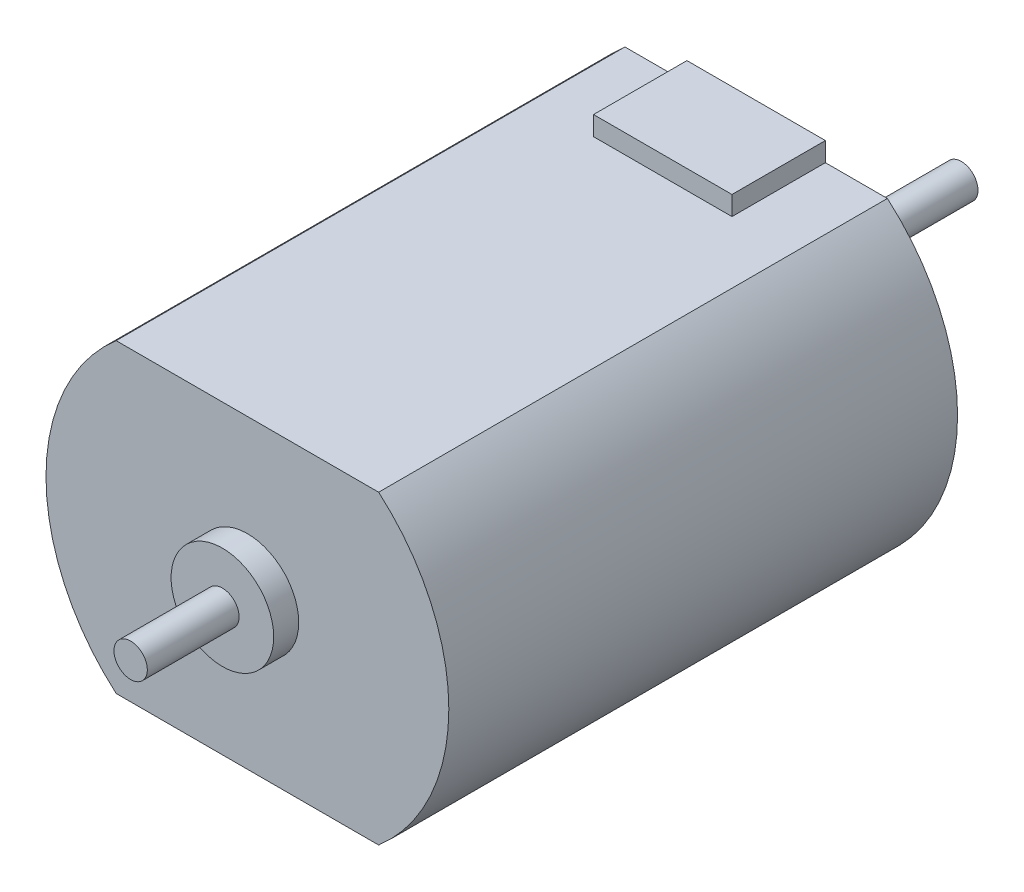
ISO-10303-21;
HEADER;
FILE_DESCRIPTION(('STEP AP214'),'2;1');
FILE_NAME('part.step','',(''),(''),'','','');
FILE_SCHEMA(('AUTOMOTIVE_DESIGN { 1 0 10303 214 1 1 1 1 }'));
ENDSEC;
DATA;
#1=APPLICATION_CONTEXT('core data for automotive mechanical design processes');
#2=APPLICATION_PROTOCOL_DEFINITION('international standard','automotive_design',2000,#1);
#3=PRODUCT_CONTEXT('',#1,'mechanical');
#4=PRODUCT('Part','Part','',(#3));
#5=PRODUCT_RELATED_PRODUCT_CATEGORY('part','',(#4));
#6=PRODUCT_DEFINITION_FORMATION('','',#4);
#7=PRODUCT_DEFINITION_CONTEXT('part definition',#1,'design');
#8=PRODUCT_DEFINITION('design','',#6,#7);
#9=PRODUCT_DEFINITION_SHAPE('','',#8);
#10=(LENGTH_UNIT() NAMED_UNIT(*) SI_UNIT(.MILLI.,.METRE.));
#11=(NAMED_UNIT(*) PLANE_ANGLE_UNIT() SI_UNIT($,.RADIAN.));
#12=(NAMED_UNIT(*) SI_UNIT($,.STERADIAN.) SOLID_ANGLE_UNIT());
#13=UNCERTAINTY_MEASURE_WITH_UNIT(LENGTH_MEASURE(1.E-05),#10,'distance_accuracy_value','');
#14=(GEOMETRIC_REPRESENTATION_CONTEXT(3) GLOBAL_UNCERTAINTY_ASSIGNED_CONTEXT((#13)) GLOBAL_UNIT_ASSIGNED_CONTEXT((#10,
#11,#12)) REPRESENTATION_CONTEXT('',''));
#15=CARTESIAN_POINT('',(0.,0.,0.));
#16=DIRECTION('',(0.,0.,1.));
#17=DIRECTION('',(1.,0.,0.));
#18=AXIS2_PLACEMENT_3D('',#15,#16,#17);
#19=CARTESIAN_POINT('',(-7.86765689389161,9.16,30.5));
#20=DIRECTION('',(0.,-1.,0.));
#21=DIRECTION('',(0.,0.,-1.));
#22=AXIS2_PLACEMENT_3D('',#19,#20,#21);
#23=PLANE('',#22);
#24=DIRECTION('',(0.,0.,1.));
#25=VECTOR('',#24,1.);
#26=CARTESIAN_POINT('',(-4.15,9.16,0.));
#27=LINE('',#26,#25);
#28=CARTESIAN_POINT('',(-4.15,9.16,0.));
#29=VERTEX_POINT('',#28);
#30=CARTESIAN_POINT('',(-4.15,9.16,5.6));
#31=VERTEX_POINT('',#30);
#32=EDGE_CURVE('E68',#29,#31,#27,.T.);
#33=ORIENTED_EDGE('',*,*,#32,.F.);
#34=DIRECTION('',(-1.,0.,0.));
#35=VECTOR('',#34,1.);
#36=CARTESIAN_POINT('',(-7.86765689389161,9.16,0.));
#37=LINE('',#36,#35);
#38=CARTESIAN_POINT('',(-7.86765689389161,9.16,0.));
#39=VERTEX_POINT('',#38);
#40=EDGE_CURVE('E177',#29,#39,#37,.T.);
#41=ORIENTED_EDGE('',*,*,#40,.T.);
#42=DIRECTION('',(0.,0.,-1.));
#43=VECTOR('',#42,1.);
#44=CARTESIAN_POINT('',(-7.86765689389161,9.16,30.5));
#45=LINE('',#44,#43);
#46=CARTESIAN_POINT('',(-7.86765689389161,9.16,30.5));
#47=VERTEX_POINT('',#46);
#48=EDGE_CURVE('E192',#47,#39,#45,.T.);
#49=ORIENTED_EDGE('',*,*,#48,.F.);
#50=DIRECTION('',(-1.,0.,0.));
#51=VECTOR('',#50,1.);
#52=CARTESIAN_POINT('',(-7.86765689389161,9.16,30.5));
#53=LINE('',#52,#51);
#54=CARTESIAN_POINT('',(7.86765689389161,9.16,30.5));
#55=VERTEX_POINT('',#54);
#56=EDGE_CURVE('E163',#55,#47,#53,.T.);
#57=ORIENTED_EDGE('',*,*,#56,.F.);
#58=DIRECTION('',(0.,0.,-1.));
#59=VECTOR('',#58,1.);
#60=CARTESIAN_POINT('',(7.86765689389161,9.16,30.5));
#61=LINE('',#60,#59);
#62=CARTESIAN_POINT('',(7.86765689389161,9.16,0.));
#63=VERTEX_POINT('',#62);
#64=EDGE_CURVE('E49',#55,#63,#61,.T.);
#65=ORIENTED_EDGE('',*,*,#64,.T.);
#66=CARTESIAN_POINT('',(4.15,9.16,0.));
#67=VERTEX_POINT('',#66);
#68=EDGE_CURVE('E178',#63,#67,#37,.T.);
#69=ORIENTED_EDGE('',*,*,#68,.T.);
#70=DIRECTION('',(0.,0.,-1.));
#71=VECTOR('',#70,1.);
#72=CARTESIAN_POINT('',(4.15,9.16,0.));
#73=LINE('',#72,#71);
#74=CARTESIAN_POINT('',(4.15,9.16,5.6));
#75=VERTEX_POINT('',#74);
#76=EDGE_CURVE('E132',#75,#67,#73,.T.);
#77=ORIENTED_EDGE('',*,*,#76,.F.);
#78=DIRECTION('',(1.,0.,0.));
#79=VECTOR('',#78,1.);
#80=CARTESIAN_POINT('',(-4.15,9.16,5.6));
#81=LINE('',#80,#79);
#82=EDGE_CURVE('E63',#31,#75,#81,.T.);
#83=ORIENTED_EDGE('',*,*,#82,.F.);
#84=EDGE_LOOP('',(#33,#41,#49,#57,#65,#69,#77,#83));
#85=FACE_BOUND('',#84,.T.);
#86=ADVANCED_FACE('F45',(#85),#23,.F.);
#87=CARTESIAN_POINT('',(0.,0.,30.5));
#88=DIRECTION('',(0.,0.,-1.));
#89=DIRECTION('',(-1.,0.,0.));
#90=AXIS2_PLACEMENT_3D('',#87,#88,#89);
#91=CYLINDRICAL_SURFACE('',#90,12.075);
#92=CARTESIAN_POINT('',(0.,0.,0.));
#93=DIRECTION('',(0.,0.,1.));
#94=DIRECTION('',(1.,0.,0.));
#95=AXIS2_PLACEMENT_3D('',#92,#93,#94);
#96=CIRCLE('',#95,12.075);
#97=CARTESIAN_POINT('',(7.86765689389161,-9.16,0.));
#98=VERTEX_POINT('',#97);
#99=EDGE_CURVE('E155',#98,#63,#96,.T.);
#100=ORIENTED_EDGE('',*,*,#99,.T.);
#101=ORIENTED_EDGE('',*,*,#64,.F.);
#102=CARTESIAN_POINT('',(0.,0.,30.5));
#103=DIRECTION('',(0.,0.,1.));
#104=DIRECTION('',(1.,0.,0.));
#105=AXIS2_PLACEMENT_3D('',#102,#103,#104);
#106=CIRCLE('',#105,12.075);
#107=CARTESIAN_POINT('',(7.86765689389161,-9.16,30.5));
#108=VERTEX_POINT('',#107);
#109=EDGE_CURVE('E159',#108,#55,#106,.T.);
#110=ORIENTED_EDGE('',*,*,#109,.F.);
#111=DIRECTION('',(0.,0.,-1.));
#112=VECTOR('',#111,1.);
#113=CARTESIAN_POINT('',(7.86765689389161,-9.16,30.5));
#114=LINE('',#113,#112);
#115=EDGE_CURVE('E173',#108,#98,#114,.T.);
#116=ORIENTED_EDGE('',*,*,#115,.T.);
#117=EDGE_LOOP('',(#100,#101,#110,#116));
#118=FACE_BOUND('',#117,.T.);
#119=ADVANCED_FACE('F47',(#118),#91,.T.);
#120=CARTESIAN_POINT('',(0.,0.,30.5));
#121=DIRECTION('',(0.,0.,-1.));
#122=DIRECTION('',(-1.,0.,0.));
#123=AXIS2_PLACEMENT_3D('',#120,#121,#122);
#124=CYLINDRICAL_SURFACE('',#123,12.075);
#125=CARTESIAN_POINT('',(0.,0.,0.));
#126=DIRECTION('',(0.,0.,1.));
#127=DIRECTION('',(1.,0.,0.));
#128=AXIS2_PLACEMENT_3D('',#125,#126,#127);
#129=CIRCLE('',#128,12.075);
#130=CARTESIAN_POINT('',(-7.86765689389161,-9.16,0.));
#131=VERTEX_POINT('',#130);
#132=EDGE_CURVE('E181',#39,#131,#129,.T.);
#133=ORIENTED_EDGE('',*,*,#132,.T.);
#134=DIRECTION('',(0.,0.,-1.));
#135=VECTOR('',#134,1.);
#136=CARTESIAN_POINT('',(-7.86765689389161,-9.16,30.5));
#137=LINE('',#136,#135);
#138=CARTESIAN_POINT('',(-7.86765689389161,-9.16,30.5));
#139=VERTEX_POINT('',#138);
#140=EDGE_CURVE('E189',#139,#131,#137,.T.);
#141=ORIENTED_EDGE('',*,*,#140,.F.);
#142=CARTESIAN_POINT('',(0.,0.,30.5));
#143=DIRECTION('',(0.,0.,1.));
#144=DIRECTION('',(1.,0.,0.));
#145=AXIS2_PLACEMENT_3D('',#142,#143,#144);
#146=CIRCLE('',#145,12.075);
#147=EDGE_CURVE('E167',#47,#139,#146,.T.);
#148=ORIENTED_EDGE('',*,*,#147,.F.);
#149=ORIENTED_EDGE('',*,*,#48,.T.);
#150=EDGE_LOOP('',(#133,#141,#148,#149));
#151=FACE_BOUND('',#150,.T.);
#152=ADVANCED_FACE('F268',(#151),#124,.T.);
#153=CARTESIAN_POINT('',(-7.86765689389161,-9.16,30.5));
#154=DIRECTION('',(0.,1.,0.));
#155=DIRECTION('',(0.,0.,1.));
#156=AXIS2_PLACEMENT_3D('',#153,#154,#155);
#157=PLANE('',#156);
#158=DIRECTION('',(1.,0.,0.));
#159=VECTOR('',#158,1.);
#160=CARTESIAN_POINT('',(-7.86765689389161,-9.16,0.));
#161=LINE('',#160,#159);
#162=EDGE_CURVE('E164',#131,#98,#161,.T.);
#163=ORIENTED_EDGE('',*,*,#162,.T.);
#164=ORIENTED_EDGE('',*,*,#115,.F.);
#165=DIRECTION('',(1.,0.,0.));
#166=VECTOR('',#165,1.);
#167=CARTESIAN_POINT('',(-7.86765689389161,-9.16,30.5));
#168=LINE('',#167,#166);
#169=EDGE_CURVE('E170',#139,#108,#168,.T.);
#170=ORIENTED_EDGE('',*,*,#169,.F.);
#171=ORIENTED_EDGE('',*,*,#140,.T.);
#172=EDGE_LOOP('',(#163,#164,#170,#171));
#173=FACE_BOUND('',#172,.T.);
#174=ADVANCED_FACE('F263',(#173),#157,.F.);
#175=CARTESIAN_POINT('',(0.,0.,30.5));
#176=DIRECTION('',(0.,0.,1.));
#177=DIRECTION('',(1.,0.,0.));
#178=AXIS2_PLACEMENT_3D('',#175,#176,#177);
#179=PLANE('',#178);
#180=CARTESIAN_POINT('',(0.,0.,30.5));
#181=DIRECTION('',(0.,0.,1.));
#182=DIRECTION('',(1.,0.,0.));
#183=AXIS2_PLACEMENT_3D('',#180,#181,#182);
#184=CIRCLE('',#183,3.075);
#185=CARTESIAN_POINT('',(3.075,0.,30.5));
#186=VERTEX_POINT('',#185);
#187=EDGE_CURVE('E55',#186,#186,#184,.T.);
#188=ORIENTED_EDGE('',*,*,#187,.F.);
#189=EDGE_LOOP('',(#188));
#190=FACE_BOUND('',#189,.T.);
#191=ORIENTED_EDGE('',*,*,#109,.T.);
#192=ORIENTED_EDGE('',*,*,#56,.T.);
#193=ORIENTED_EDGE('',*,*,#147,.T.);
#194=ORIENTED_EDGE('',*,*,#169,.T.);
#195=EDGE_LOOP('',(#191,#192,#193,#194));
#196=FACE_BOUND('',#195,.T.);
#197=ADVANCED_FACE('F260',(#190,#196),#179,.T.);
#198=CARTESIAN_POINT('',(0.,0.,0.));
#199=DIRECTION('',(0.,0.,1.));
#200=DIRECTION('',(1.,0.,0.));
#201=AXIS2_PLACEMENT_3D('',#198,#199,#200);
#202=PLANE('',#201);
#203=CARTESIAN_POINT('',(0.,0.,0.));
#204=DIRECTION('',(0.,0.,-1.));
#205=DIRECTION('',(-1.,0.,0.));
#206=AXIS2_PLACEMENT_3D('',#203,#204,#205);
#207=CIRCLE('',#206,4.23);
#208=CARTESIAN_POINT('',(-4.23,0.,0.));
#209=VERTEX_POINT('',#208);
#210=EDGE_CURVE('E151',#209,#209,#207,.T.);
#211=ORIENTED_EDGE('',*,*,#210,.F.);
#212=EDGE_LOOP('',(#211));
#213=FACE_BOUND('',#212,.T.);
#214=ORIENTED_EDGE('',*,*,#99,.F.);
#215=ORIENTED_EDGE('',*,*,#162,.F.);
#216=ORIENTED_EDGE('',*,*,#132,.F.);
#217=ORIENTED_EDGE('',*,*,#40,.F.);
#218=DIRECTION('',(0.,-1.,0.));
#219=VECTOR('',#218,1.);
#220=CARTESIAN_POINT('',(-4.15,10.31,0.));
#221=LINE('',#220,#219);
#222=CARTESIAN_POINT('',(-4.15,10.31,0.));
#223=VERTEX_POINT('',#222);
#224=EDGE_CURVE('E214',#223,#29,#221,.T.);
#225=ORIENTED_EDGE('',*,*,#224,.F.);
#226=DIRECTION('',(-1.,0.,0.));
#227=VECTOR('',#226,1.);
#228=CARTESIAN_POINT('',(-4.15,10.31,0.));
#229=LINE('',#228,#227);
#230=CARTESIAN_POINT('',(4.15,10.31,0.));
#231=VERTEX_POINT('',#230);
#232=EDGE_CURVE('E127',#231,#223,#229,.T.);
#233=ORIENTED_EDGE('',*,*,#232,.F.);
#234=DIRECTION('',(0.,-1.,0.));
#235=VECTOR('',#234,1.);
#236=CARTESIAN_POINT('',(4.15,10.31,0.));
#237=LINE('',#236,#235);
#238=EDGE_CURVE('E143',#231,#67,#237,.T.);
#239=ORIENTED_EDGE('',*,*,#238,.T.);
#240=ORIENTED_EDGE('',*,*,#68,.F.);
#241=EDGE_LOOP('',(#214,#215,#216,#217,#225,#233,#239,#240));
#242=FACE_BOUND('',#241,.T.);
#243=ADVANCED_FACE('F209',(#213,#242),#202,.F.);
#244=CARTESIAN_POINT('',(0.,0.,-2.));
#245=DIRECTION('',(0.,0.,1.));
#246=DIRECTION('',(1.,0.,0.));
#247=AXIS2_PLACEMENT_3D('',#244,#245,#246);
#248=CYLINDRICAL_SURFACE('',#247,4.23);
#249=CARTESIAN_POINT('',(0.,0.,-2.));
#250=DIRECTION('',(0.,0.,-1.));
#251=DIRECTION('',(-1.,0.,0.));
#252=AXIS2_PLACEMENT_3D('',#249,#250,#251);
#253=CIRCLE('',#252,4.23);
#254=CARTESIAN_POINT('',(-4.23,0.,-2.));
#255=VERTEX_POINT('',#254);
#256=EDGE_CURVE('E141',#255,#255,#253,.T.);
#257=ORIENTED_EDGE('',*,*,#256,.F.);
#258=EDGE_LOOP('',(#257));
#259=FACE_BOUND('',#258,.T.);
#260=ORIENTED_EDGE('',*,*,#210,.T.);
#261=EDGE_LOOP('',(#260));
#262=FACE_BOUND('',#261,.T.);
#263=ADVANCED_FACE('F293',(#259,#262),#248,.T.);
#264=CARTESIAN_POINT('',(0.,0.,-2.));
#265=DIRECTION('',(0.,0.,-1.));
#266=DIRECTION('',(-1.,0.,0.));
#267=AXIS2_PLACEMENT_3D('',#264,#265,#266);
#268=PLANE('',#267);
#269=CARTESIAN_POINT('',(0.,0.,-2.));
#270=DIRECTION('',(0.,0.,-1.));
#271=DIRECTION('',(-1.,0.,0.));
#272=AXIS2_PLACEMENT_3D('',#269,#270,#271);
#273=CIRCLE('',#272,1.);
#274=CARTESIAN_POINT('',(1.,0.,-2.));
#275=VERTEX_POINT('',#274);
#276=EDGE_CURVE('E147',#275,#275,#273,.T.);
#277=ORIENTED_EDGE('',*,*,#276,.F.);
#278=EDGE_LOOP('',(#277));
#279=FACE_BOUND('',#278,.T.);
#280=ORIENTED_EDGE('',*,*,#256,.T.);
#281=EDGE_LOOP('',(#280));
#282=FACE_BOUND('',#281,.T.);
#283=ADVANCED_FACE('F367',(#279,#282),#268,.T.);
#284=CARTESIAN_POINT('',(0.,0.,-12.3));
#285=DIRECTION('',(0.,0.,1.));
#286=DIRECTION('',(1.,0.,0.));
#287=AXIS2_PLACEMENT_3D('',#284,#285,#286);
#288=CYLINDRICAL_SURFACE('',#287,1.);
#289=CARTESIAN_POINT('',(0.,0.,-12.3));
#290=DIRECTION('',(0.,0.,-1.));
#291=DIRECTION('',(-1.,0.,0.));
#292=AXIS2_PLACEMENT_3D('',#289,#290,#291);
#293=CIRCLE('',#292,1.);
#294=CARTESIAN_POINT('',(1.,0.,-12.3));
#295=VERTEX_POINT('',#294);
#296=EDGE_CURVE('E136',#295,#295,#293,.T.);
#297=CARTESIAN_POINT('',(1.,0.,-12.3));
#298=CARTESIAN_POINT('',(1.,0.,-12.1927083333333));
#299=CARTESIAN_POINT('',(1.,0.,-12.0854166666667));
#300=CARTESIAN_POINT('',(1.,0.,-11.8708333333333));
#301=CARTESIAN_POINT('',(1.,0.,-11.7635416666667));
#302=CARTESIAN_POINT('',(1.,0.,-11.5489583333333));
#303=CARTESIAN_POINT('',(1.,0.,-11.4416666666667));
#304=CARTESIAN_POINT('',(1.,0.,-11.2270833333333));
#305=CARTESIAN_POINT('',(1.,0.,-11.1197916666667));
#306=CARTESIAN_POINT('',(1.,0.,-10.9052083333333));
#307=CARTESIAN_POINT('',(1.,0.,-10.7979166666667));
#308=CARTESIAN_POINT('',(1.,0.,-10.5833333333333));
#309=CARTESIAN_POINT('',(1.,0.,-10.4760416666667));
#310=CARTESIAN_POINT('',(1.,0.,-10.2614583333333));
#311=CARTESIAN_POINT('',(1.,0.,-10.1541666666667));
#312=CARTESIAN_POINT('',(1.,0.,-9.93958333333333));
#313=CARTESIAN_POINT('',(1.,0.,-9.83229166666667));
#314=CARTESIAN_POINT('',(1.,0.,-9.61770833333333));
#315=CARTESIAN_POINT('',(1.,0.,-9.51041666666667));
#316=CARTESIAN_POINT('',(1.,0.,-9.29583333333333));
#317=CARTESIAN_POINT('',(1.,0.,-9.18854166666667));
#318=CARTESIAN_POINT('',(1.,0.,-8.97395833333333));
#319=CARTESIAN_POINT('',(1.,0.,-8.86666666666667));
#320=CARTESIAN_POINT('',(1.,0.,-8.65208333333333));
#321=CARTESIAN_POINT('',(1.,0.,-8.54479166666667));
#322=CARTESIAN_POINT('',(1.,0.,-8.33020833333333));
#323=CARTESIAN_POINT('',(1.,0.,-8.22291666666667));
#324=CARTESIAN_POINT('',(1.,0.,-8.00833333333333));
#325=CARTESIAN_POINT('',(1.,0.,-7.90104166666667));
#326=CARTESIAN_POINT('',(1.,0.,-7.68645833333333));
#327=CARTESIAN_POINT('',(1.,0.,-7.57916666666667));
#328=CARTESIAN_POINT('',(1.,0.,-7.36458333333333));
#329=CARTESIAN_POINT('',(1.,0.,-7.25729166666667));
#330=CARTESIAN_POINT('',(1.,0.,-7.04270833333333));
#331=CARTESIAN_POINT('',(1.,0.,-6.93541666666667));
#332=CARTESIAN_POINT('',(1.,0.,-6.72083333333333));
#333=CARTESIAN_POINT('',(1.,0.,-6.61354166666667));
#334=CARTESIAN_POINT('',(1.,0.,-6.39895833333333));
#335=CARTESIAN_POINT('',(1.,0.,-6.29166666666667));
#336=CARTESIAN_POINT('',(1.,0.,-6.07708333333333));
#337=CARTESIAN_POINT('',(1.,0.,-5.96979166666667));
#338=CARTESIAN_POINT('',(1.,0.,-5.75520833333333));
#339=CARTESIAN_POINT('',(1.,0.,-5.64791666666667));
#340=CARTESIAN_POINT('',(1.,0.,-5.43333333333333));
#341=CARTESIAN_POINT('',(1.,0.,-5.32604166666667));
#342=CARTESIAN_POINT('',(1.,0.,-5.11145833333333));
#343=CARTESIAN_POINT('',(1.,0.,-5.00416666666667));
#344=CARTESIAN_POINT('',(1.,0.,-4.78958333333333));
#345=CARTESIAN_POINT('',(1.,0.,-4.68229166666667));
#346=CARTESIAN_POINT('',(1.,0.,-4.46770833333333));
#347=CARTESIAN_POINT('',(1.,0.,-4.36041666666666));
#348=CARTESIAN_POINT('',(1.,0.,-4.14583333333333));
#349=CARTESIAN_POINT('',(1.,0.,-4.03854166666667));
#350=CARTESIAN_POINT('',(1.,0.,-3.82395833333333));
#351=CARTESIAN_POINT('',(1.,0.,-3.71666666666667));
#352=CARTESIAN_POINT('',(1.,0.,-3.50208333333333));
#353=CARTESIAN_POINT('',(1.,0.,-3.39479166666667));
#354=CARTESIAN_POINT('',(1.,0.,-3.18020833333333));
#355=CARTESIAN_POINT('',(1.,0.,-3.07291666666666));
#356=CARTESIAN_POINT('',(1.,0.,-2.85833333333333));
#357=CARTESIAN_POINT('',(1.,0.,-2.75104166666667));
#358=CARTESIAN_POINT('',(1.,0.,-2.53645833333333));
#359=CARTESIAN_POINT('',(1.,0.,-2.42916666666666));
#360=CARTESIAN_POINT('',(1.,0.,-2.21458333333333));
#361=CARTESIAN_POINT('',(1.,0.,-2.10729166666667));
#362=CARTESIAN_POINT('',(1.,0.,-2.));
#363=B_SPLINE_CURVE_WITH_KNOTS('',3,(#297,#298,#299,#300,#301,#302,#303,#304,#305,#306,#307,
#308,#309,#310,#311,#312,#313,#314,#315,#316,#317,#318,#319,#320,#321,#322,#323,#324,#325,#326,
#327,#328,#329,#330,#331,#332,#333,#334,#335,#336,#337,#338,#339,#340,#341,#342,#343,#344,#345,
#346,#347,#348,#349,#350,#351,#352,#353,#354,#355,#356,#357,#358,#359,#360,#361,#362),
.UNSPECIFIED.,.F.,.F.,(4,2,2,2,2,2,2,2,2,2,2,2,2,2,2,2,2,2,2,2,2,2,2,2,2,2,2,2,2,2,2,2,4),(0.,
0.321874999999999,0.643749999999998,0.965625,1.2875,1.609375,1.93125,2.253125,2.575,2.896875,
3.21875,3.540625,3.8625,4.184375,4.50625,4.828125,5.15,5.471875,5.79375,6.115625,6.4375,
6.759375,7.08125,7.403125,7.725,8.046875,8.36875,8.690625,9.0125,9.334375,9.65625,9.978125,
10.3),.UNSPECIFIED.);
#364=EDGE_CURVE('BSEAM364',#295,#275,#363,.T.);
#365=ORIENTED_EDGE('',*,*,#296,.F.);
#366=ORIENTED_EDGE('',*,*,#276,.T.);
#367=ORIENTED_EDGE('',*,*,#364,.T.);
#368=ORIENTED_EDGE('',*,*,#364,.F.);
#369=EDGE_LOOP('',(#365,#367,#366,#368));
#370=FACE_BOUND('',#369,.T.);
#371=ADVANCED_FACE('F364',(#370),#288,.T.);
#372=CARTESIAN_POINT('',(0.,0.,-12.3));
#373=DIRECTION('',(0.,0.,-1.));
#374=DIRECTION('',(-1.,0.,0.));
#375=AXIS2_PLACEMENT_3D('',#372,#373,#374);
#376=PLANE('',#375);
#377=ORIENTED_EDGE('',*,*,#296,.T.);
#378=EDGE_LOOP('',(#377));
#379=FACE_BOUND('',#378,.T.);
#380=ADVANCED_FACE('F286',(#379),#376,.T.);
#381=CARTESIAN_POINT('',(-4.15,10.31,0.));
#382=DIRECTION('',(1.,0.,0.));
#383=DIRECTION('',(0.,0.,-1.));
#384=AXIS2_PLACEMENT_3D('',#381,#382,#383);
#385=PLANE('',#384);
#386=ORIENTED_EDGE('',*,*,#32,.T.);
#387=DIRECTION('',(0.,-1.,0.));
#388=VECTOR('',#387,1.);
#389=CARTESIAN_POINT('',(-4.15,10.31,5.6));
#390=LINE('',#389,#388);
#391=CARTESIAN_POINT('',(-4.15,10.31,5.6));
#392=VERTEX_POINT('',#391);
#393=EDGE_CURVE('E115',#392,#31,#390,.T.);
#394=ORIENTED_EDGE('',*,*,#393,.F.);
#395=DIRECTION('',(0.,0.,1.));
#396=VECTOR('',#395,1.);
#397=CARTESIAN_POINT('',(-4.15,10.31,0.));
#398=LINE('',#397,#396);
#399=EDGE_CURVE('E122',#223,#392,#398,.T.);
#400=ORIENTED_EDGE('',*,*,#399,.F.);
#401=ORIENTED_EDGE('',*,*,#224,.T.);
#402=EDGE_LOOP('',(#386,#394,#400,#401));
#403=FACE_BOUND('',#402,.T.);
#404=ADVANCED_FACE('F134',(#403),#385,.F.);
#405=CARTESIAN_POINT('',(-4.15,10.31,5.6));
#406=DIRECTION('',(0.,0.,-1.));
#407=DIRECTION('',(-1.,0.,0.));
#408=AXIS2_PLACEMENT_3D('',#405,#406,#407);
#409=PLANE('',#408);
#410=ORIENTED_EDGE('',*,*,#82,.T.);
#411=DIRECTION('',(0.,-1.,0.));
#412=VECTOR('',#411,1.);
#413=CARTESIAN_POINT('',(4.15,10.31,5.6));
#414=LINE('',#413,#412);
#415=CARTESIAN_POINT('',(4.15,10.31,5.6));
#416=VERTEX_POINT('',#415);
#417=EDGE_CURVE('E117',#416,#75,#414,.T.);
#418=ORIENTED_EDGE('',*,*,#417,.F.);
#419=DIRECTION('',(1.,0.,0.));
#420=VECTOR('',#419,1.);
#421=CARTESIAN_POINT('',(-4.15,10.31,5.6));
#422=LINE('',#421,#420);
#423=EDGE_CURVE('E111',#392,#416,#422,.T.);
#424=ORIENTED_EDGE('',*,*,#423,.F.);
#425=ORIENTED_EDGE('',*,*,#393,.T.);
#426=EDGE_LOOP('',(#410,#418,#424,#425));
#427=FACE_BOUND('',#426,.T.);
#428=ADVANCED_FACE('F113',(#427),#409,.F.);
#429=CARTESIAN_POINT('',(4.15,10.31,0.));
#430=DIRECTION('',(-1.,0.,0.));
#431=DIRECTION('',(0.,0.,1.));
#432=AXIS2_PLACEMENT_3D('',#429,#430,#431);
#433=PLANE('',#432);
#434=ORIENTED_EDGE('',*,*,#76,.T.);
#435=ORIENTED_EDGE('',*,*,#238,.F.);
#436=DIRECTION('',(0.,0.,-1.));
#437=VECTOR('',#436,1.);
#438=CARTESIAN_POINT('',(4.15,10.31,0.));
#439=LINE('',#438,#437);
#440=EDGE_CURVE('E121',#416,#231,#439,.T.);
#441=ORIENTED_EDGE('',*,*,#440,.F.);
#442=ORIENTED_EDGE('',*,*,#417,.T.);
#443=EDGE_LOOP('',(#434,#435,#441,#442));
#444=FACE_BOUND('',#443,.T.);
#445=ADVANCED_FACE('F308',(#444),#433,.F.);
#446=CARTESIAN_POINT('',(0.,10.31,0.));
#447=DIRECTION('',(0.,1.,0.));
#448=DIRECTION('',(0.,0.,1.));
#449=AXIS2_PLACEMENT_3D('',#446,#447,#448);
#450=PLANE('',#449);
#451=ORIENTED_EDGE('',*,*,#399,.T.);
#452=ORIENTED_EDGE('',*,*,#423,.T.);
#453=ORIENTED_EDGE('',*,*,#440,.T.);
#454=ORIENTED_EDGE('',*,*,#232,.T.);
#455=EDGE_LOOP('',(#451,#452,#453,#454));
#456=FACE_BOUND('',#455,.T.);
#457=ADVANCED_FACE('F125',(#456),#450,.T.);
#458=CARTESIAN_POINT('',(0.,0.,32.));
#459=DIRECTION('',(0.,0.,-1.));
#460=DIRECTION('',(-1.,0.,0.));
#461=AXIS2_PLACEMENT_3D('',#458,#459,#460);
#462=CYLINDRICAL_SURFACE('',#461,3.075);
#463=CARTESIAN_POINT('',(0.,0.,32.));
#464=DIRECTION('',(0.,0.,1.));
#465=DIRECTION('',(1.,0.,0.));
#466=AXIS2_PLACEMENT_3D('',#463,#464,#465);
#467=CIRCLE('',#466,3.075);
#468=CARTESIAN_POINT('',(3.075,0.,32.));
#469=VERTEX_POINT('',#468);
#470=EDGE_CURVE('E224',#469,#469,#467,.T.);
#471=ORIENTED_EDGE('',*,*,#470,.F.);
#472=EDGE_LOOP('',(#471));
#473=FACE_BOUND('',#472,.T.);
#474=ORIENTED_EDGE('',*,*,#187,.T.);
#475=EDGE_LOOP('',(#474));
#476=FACE_BOUND('',#475,.T.);
#477=ADVANCED_FACE('F251',(#473,#476),#462,.T.);
#478=CARTESIAN_POINT('',(0.,0.,32.));
#479=DIRECTION('',(0.,0.,1.));
#480=DIRECTION('',(1.,0.,0.));
#481=AXIS2_PLACEMENT_3D('',#478,#479,#480);
#482=PLANE('',#481);
#483=CARTESIAN_POINT('',(0.,0.,32.));
#484=DIRECTION('',(0.,0.,1.));
#485=DIRECTION('',(1.,0.,0.));
#486=AXIS2_PLACEMENT_3D('',#483,#484,#485);
#487=CIRCLE('',#486,1.);
#488=CARTESIAN_POINT('',(1.,0.,32.));
#489=VERTEX_POINT('',#488);
#490=EDGE_CURVE('E11',#489,#489,#487,.T.);
#491=ORIENTED_EDGE('',*,*,#490,.F.);
#492=EDGE_LOOP('',(#491));
#493=FACE_BOUND('',#492,.T.);
#494=ORIENTED_EDGE('',*,*,#470,.T.);
#495=EDGE_LOOP('',(#494));
#496=FACE_BOUND('',#495,.T.);
#497=ADVANCED_FACE('F245',(#493,#496),#482,.T.);
#498=CARTESIAN_POINT('',(0.,0.,37.5));
#499=DIRECTION('',(0.,0.,-1.));
#500=DIRECTION('',(-1.,0.,0.));
#501=AXIS2_PLACEMENT_3D('',#498,#499,#500);
#502=CYLINDRICAL_SURFACE('',#501,1.);
#503=CARTESIAN_POINT('',(0.,0.,37.5));
#504=DIRECTION('',(0.,0.,1.));
#505=DIRECTION('',(1.,0.,0.));
#506=AXIS2_PLACEMENT_3D('',#503,#504,#505);
#507=CIRCLE('',#506,1.);
#508=CARTESIAN_POINT('',(1.,0.,37.5));
#509=VERTEX_POINT('',#508);
#510=EDGE_CURVE('E234',#509,#509,#507,.T.);
#511=ORIENTED_EDGE('',*,*,#510,.F.);
#512=EDGE_LOOP('',(#511));
#513=FACE_BOUND('',#512,.T.);
#514=ORIENTED_EDGE('',*,*,#490,.T.);
#515=EDGE_LOOP('',(#514));
#516=FACE_BOUND('',#515,.T.);
#517=ADVANCED_FACE('F242',(#513,#516),#502,.T.);
#518=CARTESIAN_POINT('',(0.,0.,37.5));
#519=DIRECTION('',(0.,0.,1.));
#520=DIRECTION('',(1.,0.,0.));
#521=AXIS2_PLACEMENT_3D('',#518,#519,#520);
#522=PLANE('',#521);
#523=ORIENTED_EDGE('',*,*,#510,.T.);
#524=EDGE_LOOP('',(#523));
#525=FACE_BOUND('',#524,.T.);
#526=ADVANCED_FACE('F240',(#525),#522,.T.);
#527=CLOSED_SHELL('',(#86,#119,#152,#174,#197,#243,#263,#283,#371,#380,#404,#428,#445,#457,#477,
#497,#517,#526));
#528=MANIFOLD_SOLID_BREP('B2',#527);
#529=ADVANCED_BREP_SHAPE_REPRESENTATION('',(#18,#528),#14);
#530=SHAPE_DEFINITION_REPRESENTATION(#9,#529);
ENDSEC;
END-ISO-10303-21;
